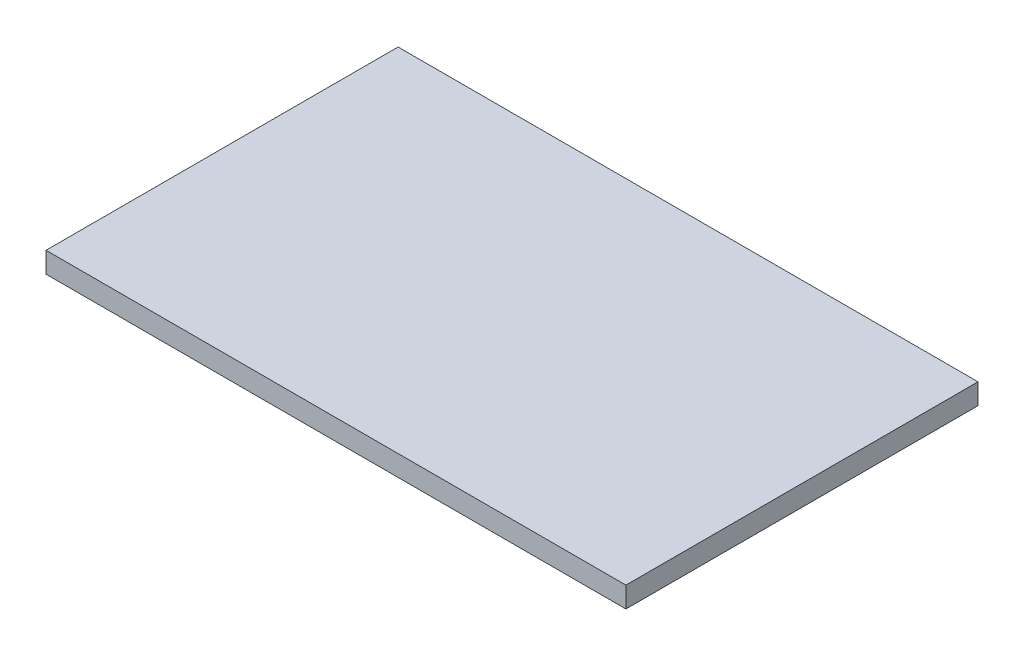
ISO-10303-21;
HEADER;
FILE_DESCRIPTION(('STEP AP214'),'2;1');
FILE_NAME('part.step','',(''),(''),'','','');
FILE_SCHEMA(('AUTOMOTIVE_DESIGN { 1 0 10303 214 1 1 1 1 }'));
ENDSEC;
DATA;
#1=APPLICATION_CONTEXT('core data for automotive mechanical design processes');
#2=APPLICATION_PROTOCOL_DEFINITION('international standard','automotive_design',2000,#1);
#3=PRODUCT_CONTEXT('',#1,'mechanical');
#4=PRODUCT('Part','Part','',(#3));
#5=PRODUCT_RELATED_PRODUCT_CATEGORY('part','',(#4));
#6=PRODUCT_DEFINITION_FORMATION('','',#4);
#7=PRODUCT_DEFINITION_CONTEXT('part definition',#1,'design');
#8=PRODUCT_DEFINITION('design','',#6,#7);
#9=PRODUCT_DEFINITION_SHAPE('','',#8);
#10=(LENGTH_UNIT() NAMED_UNIT(*) SI_UNIT(.MILLI.,.METRE.));
#11=(NAMED_UNIT(*) PLANE_ANGLE_UNIT() SI_UNIT($,.RADIAN.));
#12=(NAMED_UNIT(*) SI_UNIT($,.STERADIAN.) SOLID_ANGLE_UNIT());
#13=UNCERTAINTY_MEASURE_WITH_UNIT(LENGTH_MEASURE(1.E-05),#10,'distance_accuracy_value','');
#14=(GEOMETRIC_REPRESENTATION_CONTEXT(3) GLOBAL_UNCERTAINTY_ASSIGNED_CONTEXT((#13)) GLOBAL_UNIT_ASSIGNED_CONTEXT((#10,
#11,#12)) REPRESENTATION_CONTEXT('',''));
#15=CARTESIAN_POINT('',(0.,0.,0.));
#16=DIRECTION('',(0.,0.,1.));
#17=DIRECTION('',(1.,0.,0.));
#18=AXIS2_PLACEMENT_3D('',#15,#16,#17);
#19=CARTESIAN_POINT('',(0.,0.5,0.));
#20=DIRECTION('',(1.,0.,0.));
#21=DIRECTION('',(0.,0.,-1.));
#22=AXIS2_PLACEMENT_3D('',#19,#20,#21);
#23=PLANE('',#22);
#24=DIRECTION('',(0.,0.,1.));
#25=VECTOR('',#24,1.);
#26=CARTESIAN_POINT('',(0.,0.,0.));
#27=LINE('',#26,#25);
#28=CARTESIAN_POINT('',(0.,0.,0.));
#29=VERTEX_POINT('',#28);
#30=CARTESIAN_POINT('',(0.,0.,8.5));
#31=VERTEX_POINT('',#30);
#32=EDGE_CURVE('E77',#29,#31,#27,.T.);
#33=ORIENTED_EDGE('',*,*,#32,.T.);
#34=DIRECTION('',(0.,-1.,0.));
#35=VECTOR('',#34,1.);
#36=CARTESIAN_POINT('',(0.,0.5,8.5));
#37=LINE('',#36,#35);
#38=CARTESIAN_POINT('',(0.,0.5,8.5));
#39=VERTEX_POINT('',#38);
#40=EDGE_CURVE('E11',#39,#31,#37,.T.);
#41=ORIENTED_EDGE('',*,*,#40,.F.);
#42=DIRECTION('',(0.,0.,1.));
#43=VECTOR('',#42,1.);
#44=CARTESIAN_POINT('',(0.,0.5,0.));
#45=LINE('',#44,#43);
#46=CARTESIAN_POINT('',(0.,0.5,0.));
#47=VERTEX_POINT('',#46);
#48=EDGE_CURVE('E95',#47,#39,#45,.T.);
#49=ORIENTED_EDGE('',*,*,#48,.F.);
#50=DIRECTION('',(0.,-1.,0.));
#51=VECTOR('',#50,1.);
#52=CARTESIAN_POINT('',(0.,0.5,0.));
#53=LINE('',#52,#51);
#54=EDGE_CURVE('E89',#47,#29,#53,.T.);
#55=ORIENTED_EDGE('',*,*,#54,.T.);
#56=EDGE_LOOP('',(#33,#41,#49,#55));
#57=FACE_BOUND('',#56,.T.);
#58=ADVANCED_FACE('F33',(#57),#23,.F.);
#59=CARTESIAN_POINT('',(0.,0.5,8.5));
#60=DIRECTION('',(0.,0.,-1.));
#61=DIRECTION('',(-1.,0.,0.));
#62=AXIS2_PLACEMENT_3D('',#59,#60,#61);
#63=PLANE('',#62);
#64=DIRECTION('',(1.,0.,0.));
#65=VECTOR('',#64,1.);
#66=CARTESIAN_POINT('',(0.,0.,8.5));
#67=LINE('',#66,#65);
#68=CARTESIAN_POINT('',(14.,0.,8.5));
#69=VERTEX_POINT('',#68);
#70=EDGE_CURVE('E73',#31,#69,#67,.T.);
#71=ORIENTED_EDGE('',*,*,#70,.T.);
#72=DIRECTION('',(0.,-1.,0.));
#73=VECTOR('',#72,1.);
#74=CARTESIAN_POINT('',(14.,0.5,8.5));
#75=LINE('',#74,#73);
#76=CARTESIAN_POINT('',(14.,0.5,8.5));
#77=VERTEX_POINT('',#76);
#78=EDGE_CURVE('E40',#77,#69,#75,.T.);
#79=ORIENTED_EDGE('',*,*,#78,.F.);
#80=DIRECTION('',(1.,0.,0.));
#81=VECTOR('',#80,1.);
#82=CARTESIAN_POINT('',(0.,0.5,8.5));
#83=LINE('',#82,#81);
#84=EDGE_CURVE('E85',#39,#77,#83,.T.);
#85=ORIENTED_EDGE('',*,*,#84,.F.);
#86=ORIENTED_EDGE('',*,*,#40,.T.);
#87=EDGE_LOOP('',(#71,#79,#85,#86));
#88=FACE_BOUND('',#87,.T.);
#89=ADVANCED_FACE('F84',(#88),#63,.F.);
#90=CARTESIAN_POINT('',(14.,0.5,0.));
#91=DIRECTION('',(-1.,0.,0.));
#92=DIRECTION('',(0.,0.,1.));
#93=AXIS2_PLACEMENT_3D('',#90,#91,#92);
#94=PLANE('',#93);
#95=DIRECTION('',(0.,0.,-1.));
#96=VECTOR('',#95,1.);
#97=CARTESIAN_POINT('',(14.,0.,0.));
#98=LINE('',#97,#96);
#99=CARTESIAN_POINT('',(14.,0.,0.));
#100=VERTEX_POINT('',#99);
#101=EDGE_CURVE('E78',#69,#100,#98,.T.);
#102=ORIENTED_EDGE('',*,*,#101,.T.);
#103=DIRECTION('',(0.,-1.,0.));
#104=VECTOR('',#103,1.);
#105=CARTESIAN_POINT('',(14.,0.5,0.));
#106=LINE('',#105,#104);
#107=CARTESIAN_POINT('',(14.,0.5,0.));
#108=VERTEX_POINT('',#107);
#109=EDGE_CURVE('E101',#108,#100,#106,.T.);
#110=ORIENTED_EDGE('',*,*,#109,.F.);
#111=DIRECTION('',(0.,0.,-1.));
#112=VECTOR('',#111,1.);
#113=CARTESIAN_POINT('',(14.,0.5,0.));
#114=LINE('',#113,#112);
#115=EDGE_CURVE('E52',#77,#108,#114,.T.);
#116=ORIENTED_EDGE('',*,*,#115,.F.);
#117=ORIENTED_EDGE('',*,*,#78,.T.);
#118=EDGE_LOOP('',(#102,#110,#116,#117));
#119=FACE_BOUND('',#118,.T.);
#120=ADVANCED_FACE('F104',(#119),#94,.F.);
#121=CARTESIAN_POINT('',(0.,0.5,0.));
#122=DIRECTION('',(0.,0.,1.));
#123=DIRECTION('',(1.,0.,0.));
#124=AXIS2_PLACEMENT_3D('',#121,#122,#123);
#125=PLANE('',#124);
#126=DIRECTION('',(-1.,0.,0.));
#127=VECTOR('',#126,1.);
#128=CARTESIAN_POINT('',(0.,0.,0.));
#129=LINE('',#128,#127);
#130=EDGE_CURVE('E93',#100,#29,#129,.T.);
#131=ORIENTED_EDGE('',*,*,#130,.T.);
#132=ORIENTED_EDGE('',*,*,#54,.F.);
#133=DIRECTION('',(-1.,0.,0.));
#134=VECTOR('',#133,1.);
#135=CARTESIAN_POINT('',(0.,0.5,0.));
#136=LINE('',#135,#134);
#137=EDGE_CURVE('E47',#108,#47,#136,.T.);
#138=ORIENTED_EDGE('',*,*,#137,.F.);
#139=ORIENTED_EDGE('',*,*,#109,.T.);
#140=EDGE_LOOP('',(#131,#132,#138,#139));
#141=FACE_BOUND('',#140,.T.);
#142=ADVANCED_FACE('F106',(#141),#125,.F.);
#143=CARTESIAN_POINT('',(0.,0.5,0.));
#144=DIRECTION('',(0.,1.,0.));
#145=DIRECTION('',(0.,0.,1.));
#146=AXIS2_PLACEMENT_3D('',#143,#144,#145);
#147=PLANE('',#146);
#148=ORIENTED_EDGE('',*,*,#48,.T.);
#149=ORIENTED_EDGE('',*,*,#84,.T.);
#150=ORIENTED_EDGE('',*,*,#115,.T.);
#151=ORIENTED_EDGE('',*,*,#137,.T.);
#152=EDGE_LOOP('',(#148,#149,#150,#151));
#153=FACE_BOUND('',#152,.T.);
#154=ADVANCED_FACE('F107',(#153),#147,.T.);
#155=CARTESIAN_POINT('',(0.,0.,0.));
#156=DIRECTION('',(0.,1.,0.));
#157=DIRECTION('',(0.,0.,1.));
#158=AXIS2_PLACEMENT_3D('',#155,#156,#157);
#159=PLANE('',#158);
#160=ORIENTED_EDGE('',*,*,#32,.F.);
#161=ORIENTED_EDGE('',*,*,#130,.F.);
#162=ORIENTED_EDGE('',*,*,#101,.F.);
#163=ORIENTED_EDGE('',*,*,#70,.F.);
#164=EDGE_LOOP('',(#160,#161,#162,#163));
#165=FACE_BOUND('',#164,.T.);
#166=ADVANCED_FACE('F74',(#165),#159,.F.);
#167=CLOSED_SHELL('',(#58,#89,#120,#142,#154,#166));
#168=MANIFOLD_SOLID_BREP('B2',#167);
#169=ADVANCED_BREP_SHAPE_REPRESENTATION('',(#18,#168),#14);
#170=SHAPE_DEFINITION_REPRESENTATION(#9,#169);
ENDSEC;
END-ISO-10303-21;
